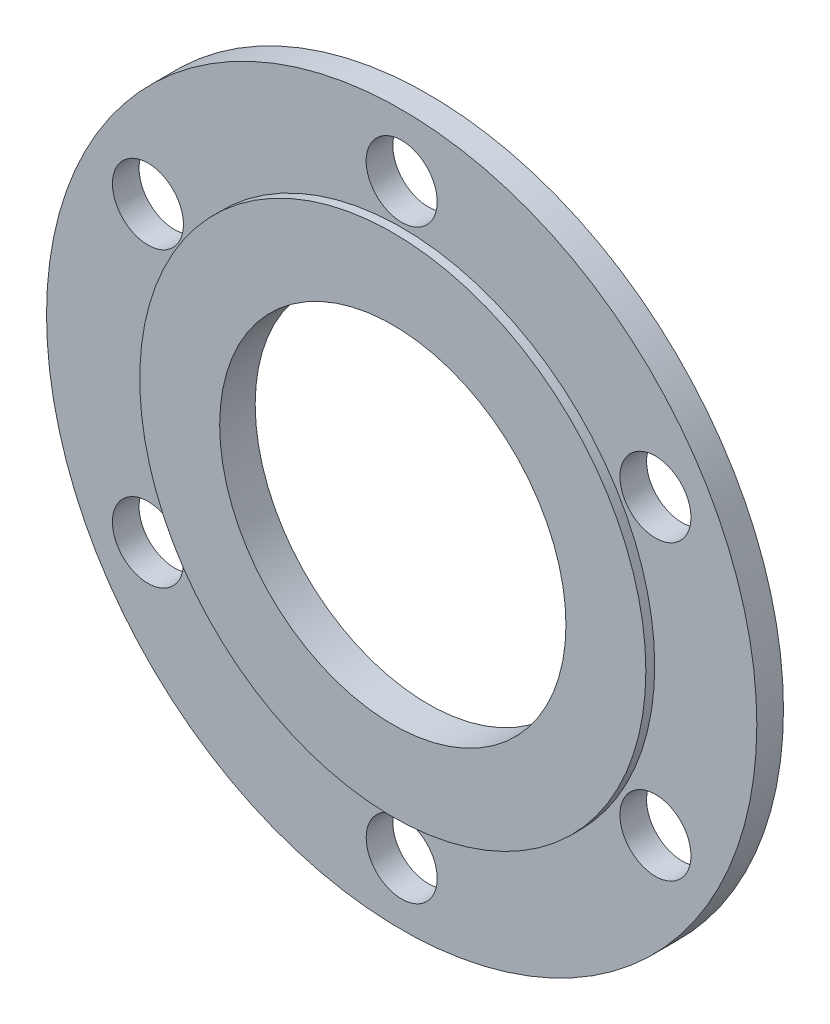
from build123d import *

# Parameters (mm, degrees)
ESQUISSE1_R                  = 40
EXTRUSION1_DEPTH             = 3
ESQUISSE2_R                  = 28.5
EXTRUSION2_DEPTH             = 1
ESQUISSE3_R                  = 19.5
ENL_V_MAT_EXTRU_1_DEPTH      = 57.709787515
ESQUISSE4_R                  = 4
ENL_V_MAT_EXTRU_2_DEPTH      = 57.648036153
R_P_TITION_CIRCULAIRE1_COUNT = 6


with BuildPart() as part:
    # Esquisse1 → Extrusion1 (new body)
    with BuildSketch(Plane.XY):
        Circle(ESQUISSE1_R)
    extrude(amount=EXTRUSION1_DEPTH)

    # Esquisse2 → Extrusion2 (add)
    with BuildSketch(Plane.XY.offset(3)):
        Circle(ESQUISSE2_R)
    extrude(amount=EXTRUSION2_DEPTH)

    # Esquisse3 → Enl_v. mat.-Extru.1 (cut, through all)
    with BuildSketch(Plane.XY.offset(4)):
        Circle(ESQUISSE3_R)
    extrude(amount=-ENL_V_MAT_EXTRU_1_DEPTH, mode=Mode.SUBTRACT)

    # Esquisse4 → Enl_v. mat.-Extru.2 (cut, through all)
    with BuildSketch(Plane.XY.offset(3)):
        with Locations((0, 33)):
            Circle(ESQUISSE4_R)
    enl_v_mat_extru_2 = extrude(amount=-ENL_V_MAT_EXTRU_2_DEPTH, mode=Mode.SUBTRACT)

    # R_p_tition circulaire1: Enl_v. mat.-Extru.2 ×6 about axis
    r_p_tition_circulaire1_axis = Axis((0, 0, 0), (0, 0, 1))
    for i in range(1, R_P_TITION_CIRCULAIRE1_COUNT):
        add(enl_v_mat_extru_2.rotate(r_p_tition_circulaire1_axis, i * 360 / R_P_TITION_CIRCULAIRE1_COUNT), mode=Mode.SUBTRACT)


solid = part.part
